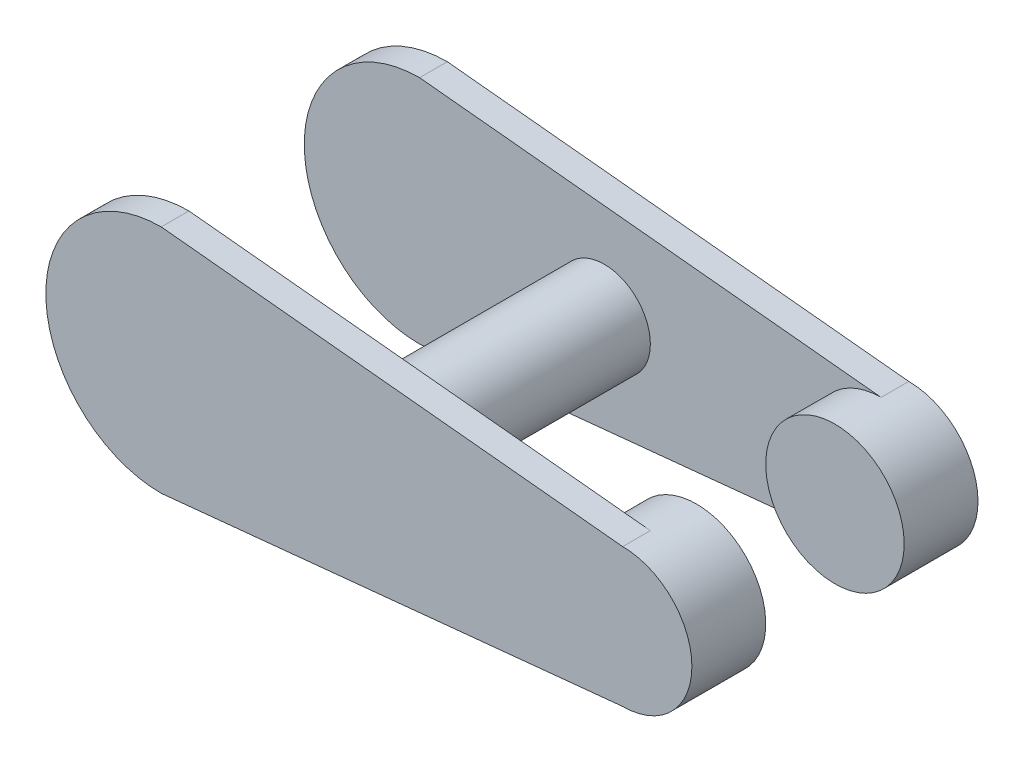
from build123d import *

# Parameters (mm, degrees)
BOSS_EXTRU_2_DEPTH         = 30
R_P_TITION_LIN_AIRE1_COUNT = 2
R_P_TITION_LIN_AIRE1_PITCH = 280
BOSS_EXTRU_3_REACH         = 1783.327
ESQUISSE4_R                = 50
ESQUISSE5_R                = 75
BOSS_EXTRU_4_DEPTH         = 50
BOSS_EXTRU_5_START         = 50
ESQUISSE6_R                = 75
BOSS_EXTRU_5_DEPTH         = 50


with BuildPart() as part:
    # Esquisse2 → Boss.-Extru.2 (new body)
    with BuildSketch(Plane.XY.offset(-125)):
        with BuildLine():
            Line((1179.73666708, 125), (1679.73666708, 75))
            ThreePointArc((1679.73666708, 75), (1754.73666708, 0), (1679.73666708, -75))
            Line((1679.73666708, -75), (1179.73666708, -125))
            ThreePointArc((1179.73666708, -125), (1054.73666708, 0), (1179.73666708, 125))
        make_face()
    extrude(amount=-BOSS_EXTRU_2_DEPTH)


with BuildPart() as r_p_tition_lin_aire1_1:
    # R_p_tition lin_aire1: pattern copy
    add(part.part.moved(Location(Vector(0, 0, 1) * (1 * R_P_TITION_LIN_AIRE1_PITCH))))


with BuildPart() as part_1:
    add(part.part)

    # Esquisse4 → Boss.-Extru.3 (add, up to next)
    with BuildSketch(Plane(origin=(0, 0, 125), x_dir=(-1, 0, 0), z_dir=(0, 0, -1)), mode=Mode.PRIVATE) as boss_extru_3_sk1:
        with Locations(Location((-1379.73666708, 0, 0), (0, 0, 180))):
            Circle(ESQUISSE4_R)
    boss_extru_3_tool1 = extrude(boss_extru_3_sk1.sketch, amount=BOSS_EXTRU_3_REACH, mode=Mode.PRIVATE) - part_1.part

    add(r_p_tition_lin_aire1_1.part)  # Boss.-Extru.3 merges R_p_tition lin_aire1_1
    add(boss_extru_3_tool1.solids().sort_by_distance((1379.736667, 0, 125))[0])

    # Esquisse5 → Boss.-Extru.4 (add)
    with BuildSketch(Plane(origin=(0, 0, 125), x_dir=(-1, 0, 0), z_dir=(0, 0, -1))):
        with Locations(Location((-1679.73666708, 0, 0), (0, 0, 270))):
            Circle(ESQUISSE5_R)
    extrude(amount=BOSS_EXTRU_4_DEPTH)

    # Esquisse6 → Boss.-Extru.5 (add)
    with BuildSketch(Plane.XY.offset(-125).offset(BOSS_EXTRU_5_START)):
        with Locations((1679.73666708, 0)):
            Circle(ESQUISSE6_R)
    extrude(amount=-BOSS_EXTRU_5_DEPTH)


solid = part_1.part
